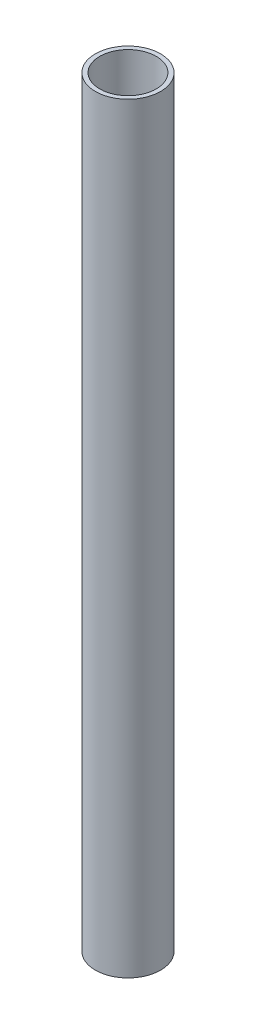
from build123d import *

# Parameters (mm, degrees)
ESQUISSE1_R      = 15
ESQUISSE1_R_2    = 13
EXTRUSION1_DEPTH = 350


with BuildPart() as part:
    # Esquisse1 → Extrusion1 (new body)
    with BuildSketch(Plane(origin=(0, 0, 0), x_dir=(1, 0, 0), z_dir=(0, 1, 0))):
        with Locations(Location((0, 0, 0), (0, 0, 270))):
            Circle(ESQUISSE1_R)
        with Locations(Location((0, 0, 0), (0, 0, 270))):
            Circle(ESQUISSE1_R_2, mode=Mode.SUBTRACT)
    extrude(amount=EXTRUSION1_DEPTH)


solid = part.part
